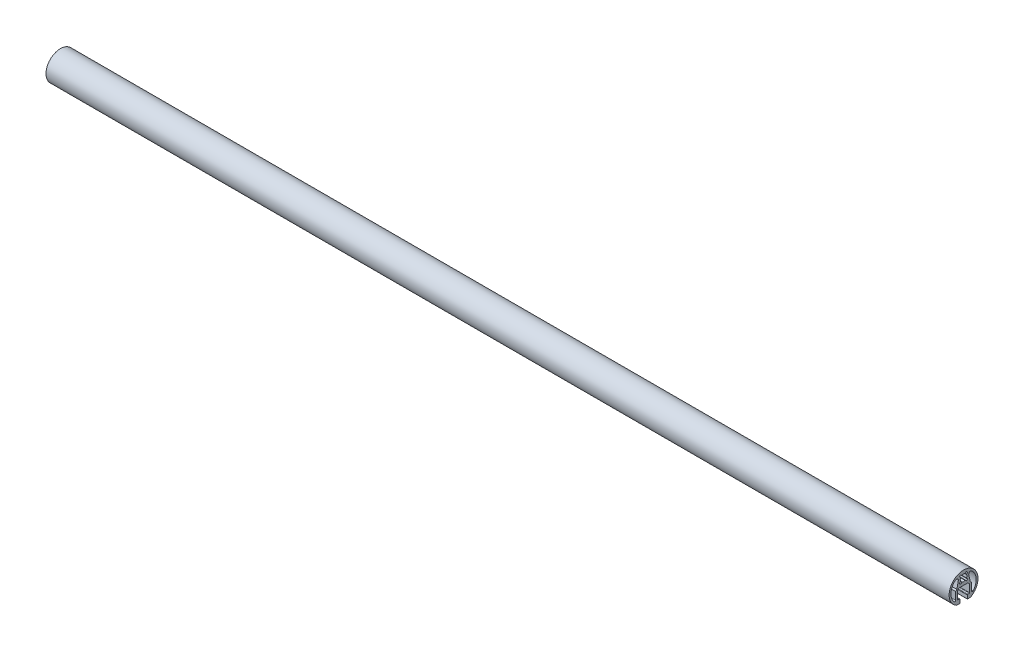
from build123d import *

# Parameters (mm, degrees)
F_45_SARJA_1_0016_KAHVAPROFIILI_32_1_DEPTH = 1000


with BuildPart() as part:
    # Model1 → 45-sarja 1.0016 KAHVAPROFIILI 32_1 (new body)
    with BuildSketch(Plane(origin=(0, 0, 0), x_dir=(0, -1, 0), z_dir=(1, 0, 0))):
        with BuildLine():
            Line((22.199998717, -4.100001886), (18.499998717, -4.100001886))
            ThreePointArc((18.499998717, -4.100001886), (18.146445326, -4.246448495), (17.999998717, -4.600001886))
            Line((17.999998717, -4.600001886), (17.999998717, -6.500001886))
            ThreePointArc((17.999998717, -6.500001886), (17.912130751, -6.71213392), (17.699998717, -6.800001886))
            Line((17.699998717, -6.800001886), (9.199998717, -6.800001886))
            Line((9.199998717, -6.800001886), (7.199998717, -4.800001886))
            Line((7.199998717, -4.800001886), (7.199998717, 4.799998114))
            Line((7.199998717, 4.799998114), (9.199998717, 6.799998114))
            Line((9.199998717, 6.799998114), (17.699998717, 6.799998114))
            ThreePointArc((17.699998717, 6.799998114), (17.912130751, 6.712130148), (17.999998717, 6.499998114))
            Line((17.999998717, 6.499998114), (17.999998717, 4.599998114))
            ThreePointArc((17.999998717, 4.599998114), (18.146445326, 4.246444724), (18.499998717, 4.099998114))
            Line((18.499998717, 4.099998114), (22.199998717, 4.099998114))
            ThreePointArc((22.199998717, 4.099998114), (22.412131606, 4.187865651), (22.5, 4.399998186))
            Line((22.5, 4.399998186), (22.5, 7.745965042))
            ThreePointArc((22.5, 7.745965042), (-7.49999987, -1.886e-06), (22.5, -7.745968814))
            Line((22.5, -7.745968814), (22.5, -4.400001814))
            ThreePointArc((22.5, -4.400001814), (22.412131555, -4.187869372), (22.199998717, -4.100001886))
        make_face()
        with BuildLine():
            Line((-3.394112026, 4.38406318), (-4.384061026, 3.39411418))
            ThreePointArc((-4.384061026, 3.39411418), (-4.471928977, 3.18198218), (-4.384061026, 2.96985018))
            Line((-4.384061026, 2.96985018), (-3.363289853, 1.949079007))
            ThreePointArc((-3.363289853, 1.949079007), (-3.279574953, 1.786692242), (-3.305578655, 1.605856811))
            ThreePointArc((-3.305578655, 1.605856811), (-3.675000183, 1.729e-06), (-3.305580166, -1.605853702))
            ThreePointArc((-3.305580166, -1.605853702), (-3.279576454, -1.786689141), (-3.363291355, -1.949075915))
            Line((-3.363291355, -1.949075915), (-4.384062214, -2.969846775))
            ThreePointArc((-4.384062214, -2.969846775), (-4.471930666, -3.181978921), (-4.384062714, -3.394111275))
            Line((-4.384062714, -3.394111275), (-3.394113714, -4.384060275))
            ThreePointArc((-3.394113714, -4.384060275), (-3.181981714, -4.471928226), (-2.969849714, -4.384060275))
            Line((-2.969849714, -4.384060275), (-1.949078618, -3.363289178))
            ThreePointArc((-1.949078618, -3.363289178), (-1.786691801, -3.27957427), (-1.605856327, -3.305578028))
            ThreePointArc((-1.605856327, -3.305578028), (-1.07e-07, -3.674999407), (1.605856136, -3.305578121))
            ThreePointArc((1.605856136, -3.305578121), (1.786691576, -3.279574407), (1.949078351, -3.363289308))
            Line((1.949078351, -3.363289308), (2.969849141, -4.384060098))
            ThreePointArc((2.969849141, -4.384060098), (3.181981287, -4.471928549), (3.394113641, -4.384060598))
            Line((3.394113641, -4.384060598), (4.384062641, -3.394111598))
            ThreePointArc((4.384062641, -3.394111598), (4.47193184, -3.181979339), (4.384064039, -2.969846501))
            Line((4.384064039, -2.969846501), (3.36329268, -1.949075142))
            ThreePointArc((3.36329268, -1.949075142), (3.279577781, -1.786688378), (3.305581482, -1.605852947))
            ThreePointArc((3.305581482, -1.605852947), (3.675001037, 1.819e-06), (3.305579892, 1.60585622))
            ThreePointArc((3.305579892, 1.60585622), (3.27957618, 1.786691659), (3.363291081, 1.949078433))
            Line((3.363291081, 1.949078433), (4.384061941, 2.969849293))
            ThreePointArc((4.384061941, 2.969849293), (4.471929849, 3.181981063), (4.384062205, 3.394112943))
            Line((4.384062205, 3.394112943), (3.394112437, 4.38406271))
            ThreePointArc((3.394112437, 4.38406271), (3.181980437, 4.471930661), (2.969848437, 4.38406271))
            Line((2.969848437, 4.38406271), (1.949077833, 3.363292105))
            ThreePointArc((1.949077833, 3.363292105), (1.786691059, 3.279577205), (1.60585562, 3.305580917))
            ThreePointArc((1.60585562, 3.305580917), (3.83e-07, 3.675001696), (-1.60585493, 3.305581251))
            ThreePointArc((-1.60585493, 3.305581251), (-1.786690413, 3.279577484), (-1.949077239, 3.363292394))
            Line((-1.949077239, 3.363292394), (-2.969847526, 4.38406268))
            ThreePointArc((-2.969847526, 4.38406268), (-3.181979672, 4.471931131), (-3.394112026, 4.38406318))
        make_face(mode=Mode.SUBTRACT)
        with BuildLine():
            Line((-0.255226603, 5.766718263), (7.313848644, 7.442278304))
            Line((7.313848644, 7.442278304), (8.671573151, 8.800002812))
            Line((8.671573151, 8.800002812), (17.041658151, 8.800002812))
            ThreePointArc((17.041658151, 8.800002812), (17.978098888, 9.449178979), (17.698709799, 10.553847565))
            ThreePointArc((17.698709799, 10.553847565), (7.415300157, 13.957914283), (-2.2187495, 9.006018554))
            ThreePointArc((-2.2187495, 9.006018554), (-2.397822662, 6.682720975), (-0.255226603, 5.766718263))
        make_face(mode=Mode.SUBTRACT)
        with BuildLine():
            Line((17.041657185, -8.800003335), (8.671573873, -8.800003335))
            Line((8.671573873, -8.800003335), (7.313849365, -7.442278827))
            Line((7.313849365, -7.442278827), (-0.255226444, -5.766718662))
            ThreePointArc((-0.255226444, -5.766718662), (-2.397821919, -6.682721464), (-2.218749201, -9.006018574))
            ThreePointArc((-2.218749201, -9.006018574), (7.415299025, -13.957915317), (17.698708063, -10.553849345))
            ThreePointArc((17.698708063, -10.553849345), (17.978098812, -9.449180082), (17.041657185, -8.800003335))
        make_face(mode=Mode.SUBTRACT)
    extrude(amount=F_45_SARJA_1_0016_KAHVAPROFIILI_32_1_DEPTH)


solid = part.part
